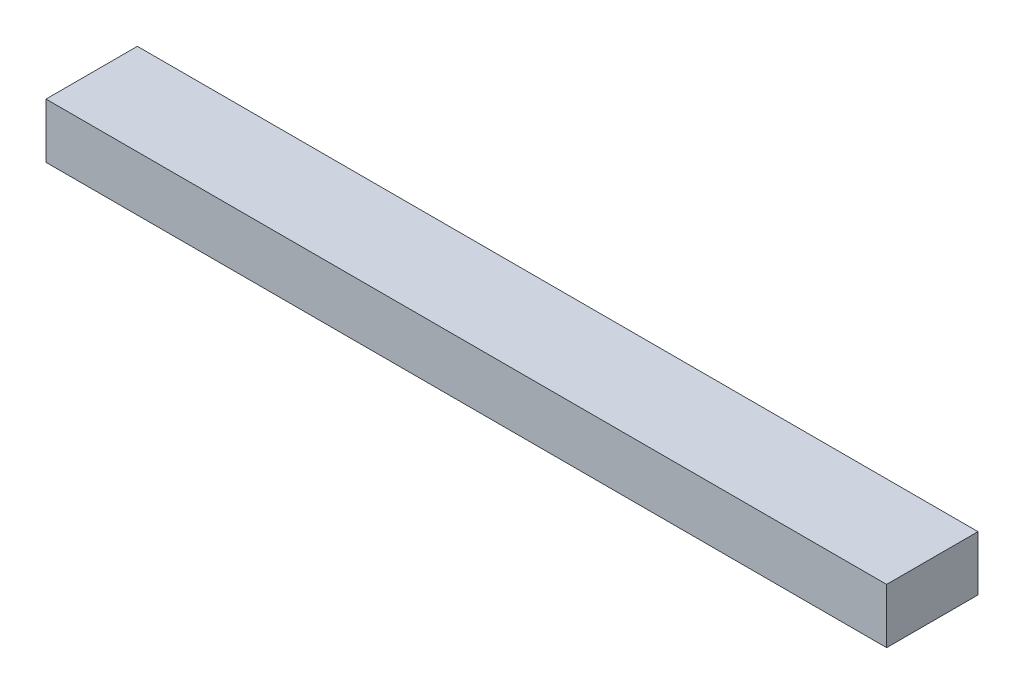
from build123d import *

# Parameters (mm, degrees)
SKETCH1_W           = 92
SKETCH1_H           = 10
BOSS_EXTRUDE1_DEPTH = 6


with BuildPart() as part:
    # Sketch1 → Boss-Extrude1 (new body)
    with BuildSketch(Plane(origin=(0, 0, 0), x_dir=(1, 0, 0), z_dir=(0, 1, 0))):
        Rectangle(SKETCH1_W, SKETCH1_H)
    extrude(amount=BOSS_EXTRUDE1_DEPTH)


solid = part.part
